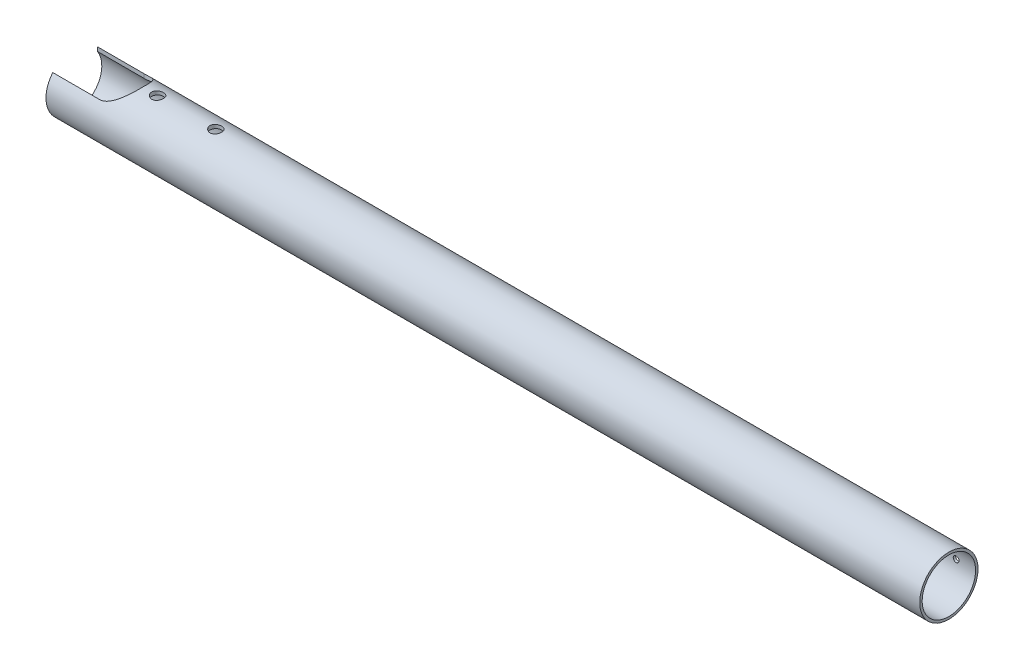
from build123d import *

# Parameters (mm, degrees)
ESQUISSE1_R             = 30
BASE_EXTRUSION_DEPTH    = 900
COQUE1_T                = -2.5
ENL_V_MAT_EXTRU_1_DEPTH = 100
ESQUISSE4_W             = 89
ESQUISSE4_H             = 20
BOSS_EXTRU_1_DEPTH      = 2
ESQUISSE3_R             = 6
ENL_V_MAT_EXTRU_2_DEPTH = 100
ESQUISSE6_R             = 3
ENL_V_MAT_EXTRU_3_DEPTH = 50


with BuildPart() as part:
    # Esquisse1 → Base-Extrusion (new body)
    with BuildSketch(Plane(origin=(0, 0, 0), x_dir=(0, 0, -1), z_dir=(1, 0, 0))):
        with Locations(Location((0, 0, 0), (0, 0, 140.05549481))):
            Circle(ESQUISSE1_R)
    extrude(amount=BASE_EXTRUSION_DEPTH)

    # Coque1
    coque1_openings = [part.faces().sort_by_distance(p)[0] for p in [
        (0, 0, 0),
        (900, 0, 0),
    ]]
    offset(amount=COQUE1_T, openings=coque1_openings, kind=Kind.INTERSECTION)

    # Esquisse2 → Enl_v. mat.-Extru.1 (cut)
    with BuildSketch(Plane(origin=(0, 0, 0), x_dir=(1, 0, 0), z_dir=(0, 1, 0))):
        with BuildLine():
            Line((-10, 23), (48, 23))
            ThreePointArc((48, 23), (63.556349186, 16.556349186), (70, 1))
            Line((70, 1), (70, -1))
            ThreePointArc((70, -1), (63.556349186, -16.556349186), (48, -23))
            Line((48, -23), (-10, -23))
            Line((-10, -23), (-10, 23))
        make_face()
    extrude(amount=ENL_V_MAT_EXTRU_1_DEPTH, mode=Mode.SUBTRACT)

    # Esquisse4 → Boss.-Extru.1 (add)
    with BuildSketch(Plane(origin=(0, 26, 0), x_dir=(-1, 0, 0), z_dir=(0, 1, 0))):
        with Locations((-115.5, 0)):
            Rectangle(ESQUISSE4_W, ESQUISSE4_H)
    extrude(amount=BOSS_EXTRU_1_DEPTH)

    # Esquisse3 → Enl_v. mat.-Extru.2 (cut)
    with BuildSketch(Plane(origin=(0, 0, 0), x_dir=(1, 0, 0), z_dir=(0, 1, 0))):
        with Locations(Location((85, 0, 0), (0, 0, 90))):
            Circle(ESQUISSE3_R)
        with Locations(Location((145, 0, 0), (0, 0, 90))):
            Circle(ESQUISSE3_R)
    extrude(amount=ENL_V_MAT_EXTRU_2_DEPTH, mode=Mode.SUBTRACT)

    # Esquisse6 → Enl_v. mat.-Extru.3 (cut)
    with BuildSketch(Plane.XY):
        with Locations((880, 0)):
            Circle(ESQUISSE6_R)
    extrude(amount=-ENL_V_MAT_EXTRU_3_DEPTH, mode=Mode.SUBTRACT)


solid = part.part
